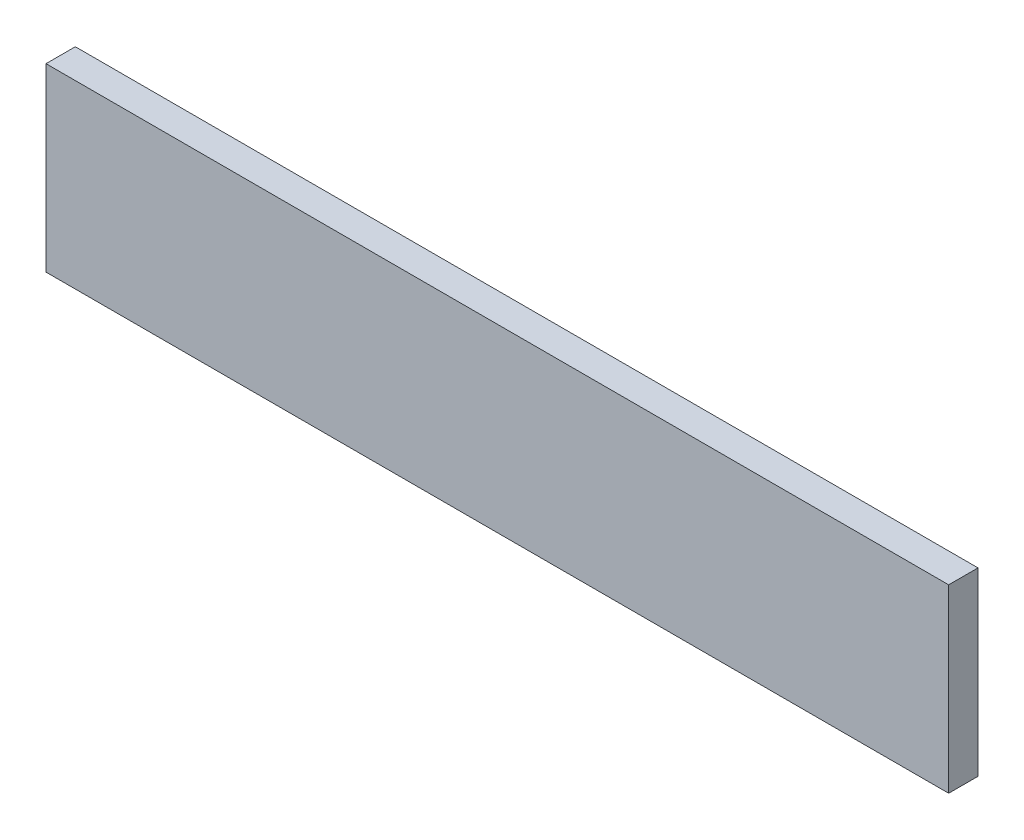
from build123d import *

# Parameters (mm, degrees)
SKETCH1_W           = 50.8
SKETCH1_H           = 254
BOSS_EXTRUDE1_DEPTH = 8.255


with BuildPart() as part:
    # Sketch1 → Boss-Extrude1 (new body)
    with BuildSketch(Plane(origin=(0, 0, 0), x_dir=(0, 1, 0), z_dir=(0, 0, 1))):
        Rectangle(SKETCH1_W, SKETCH1_H)
    extrude(amount=BOSS_EXTRUDE1_DEPTH)


solid = part.part
